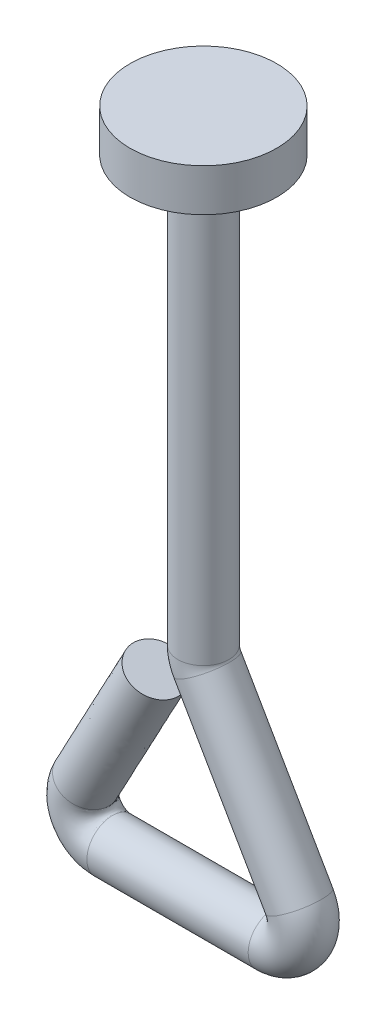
ISO-10303-21;
HEADER;
FILE_DESCRIPTION(('STEP AP214'),'2;1');
FILE_NAME('part.step','',(''),(''),'','','');
FILE_SCHEMA(('AUTOMOTIVE_DESIGN { 1 0 10303 214 1 1 1 1 }'));
ENDSEC;
DATA;
#1=APPLICATION_CONTEXT('core data for automotive mechanical design processes');
#2=APPLICATION_PROTOCOL_DEFINITION('international standard','automotive_design',2000,#1);
#3=PRODUCT_CONTEXT('',#1,'mechanical');
#4=PRODUCT('Part','Part','',(#3));
#5=PRODUCT_RELATED_PRODUCT_CATEGORY('part','',(#4));
#6=PRODUCT_DEFINITION_FORMATION('','',#4);
#7=PRODUCT_DEFINITION_CONTEXT('part definition',#1,'design');
#8=PRODUCT_DEFINITION('design','',#6,#7);
#9=PRODUCT_DEFINITION_SHAPE('','',#8);
#10=(LENGTH_UNIT() NAMED_UNIT(*) SI_UNIT(.MILLI.,.METRE.));
#11=(NAMED_UNIT(*) PLANE_ANGLE_UNIT() SI_UNIT($,.RADIAN.));
#12=(NAMED_UNIT(*) SI_UNIT($,.STERADIAN.) SOLID_ANGLE_UNIT());
#13=UNCERTAINTY_MEASURE_WITH_UNIT(LENGTH_MEASURE(1.E-05),#10,'distance_accuracy_value','');
#14=(GEOMETRIC_REPRESENTATION_CONTEXT(3) GLOBAL_UNCERTAINTY_ASSIGNED_CONTEXT((#13)) GLOBAL_UNIT_ASSIGNED_CONTEXT((#10,
#11,#12)) REPRESENTATION_CONTEXT('',''));
#15=CARTESIAN_POINT('',(0.,0.,0.));
#16=DIRECTION('',(0.,0.,1.));
#17=DIRECTION('',(1.,0.,0.));
#18=AXIS2_PLACEMENT_3D('',#15,#16,#17);
#19=CARTESIAN_POINT('',(8.27562342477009,-75.7716224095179,0.));
#20=DIRECTION('',(-1.,0.,0.));
#21=DIRECTION('',(0.,0.,1.));
#22=AXIS2_PLACEMENT_3D('',#19,#20,#21);
#23=CYLINDRICAL_SURFACE('',#22,3.);
#24=CARTESIAN_POINT('',(8.27562342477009,-75.7716224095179,0.));
#25=DIRECTION('',(1.,0.,0.));
#26=DIRECTION('',(0.,0.,1.));
#27=AXIS2_PLACEMENT_3D('',#24,#25,#26);
#28=CIRCLE('',#27,3.);
#29=CARTESIAN_POINT('',(8.27562342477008,-78.7716224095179,0.));
#30=VERTEX_POINT('',#29);
#31=EDGE_CURVE('E10',#30,#30,#28,.T.);
#32=ORIENTED_EDGE('',*,*,#31,.F.);
#33=EDGE_LOOP('',(#32));
#34=FACE_BOUND('',#33,.T.);
#35=CARTESIAN_POINT('',(-10.7243765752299,-75.7716224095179,0.));
#36=DIRECTION('',(1.,0.,0.));
#37=DIRECTION('',(0.,0.,1.));
#38=AXIS2_PLACEMENT_3D('',#35,#36,#37);
#39=CIRCLE('',#38,3.);
#40=CARTESIAN_POINT('',(-10.7243765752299,-75.7716224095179,3.));
#41=VERTEX_POINT('',#40);
#42=EDGE_CURVE('E49',#41,#41,#39,.T.);
#43=ORIENTED_EDGE('',*,*,#42,.T.);
#44=EDGE_LOOP('',(#43));
#45=FACE_BOUND('',#44,.T.);
#46=ADVANCED_FACE('F27',(#34,#45),#23,.T.);
#47=CARTESIAN_POINT('',(8.2756234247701,-72.2716224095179,0.));
#48=DIRECTION('',(0.,0.,-1.));
#49=DIRECTION('',(-1.,0.,0.));
#50=AXIS2_PLACEMENT_3D('',#47,#48,#49);
#51=TOROIDAL_SURFACE('',#50,3.50000000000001,3.);
#52=CARTESIAN_POINT('',(11.3067123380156,-70.5216224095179,0.));
#53=DIRECTION('',(-0.500000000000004,0.866025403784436,0.));
#54=DIRECTION('',(0.,0.,1.));
#55=AXIS2_PLACEMENT_3D('',#52,#53,#54);
#56=CIRCLE('',#55,3.);
#57=CARTESIAN_POINT('',(13.904788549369,-69.0216224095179,0.));
#58=VERTEX_POINT('',#57);
#59=EDGE_CURVE('E33',#58,#58,#56,.T.);
#60=CARTESIAN_POINT('',(8.2756234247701,-72.2716224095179,0.));
#61=DIRECTION('',(0.,0.,-1.));
#62=DIRECTION('',(-1.,0.,0.));
#63=AXIS2_PLACEMENT_3D('',#60,#61,#62);
#64=CIRCLE('',#63,6.50000000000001);
#65=EDGE_CURVE('',#58,#30,#64,.T.);
#66=ORIENTED_EDGE('',*,*,#59,.F.);
#67=ORIENTED_EDGE('',*,*,#31,.T.);
#68=ORIENTED_EDGE('',*,*,#65,.T.);
#69=ORIENTED_EDGE('',*,*,#65,.F.);
#70=EDGE_LOOP('',(#66,#68,#67,#69));
#71=FACE_BOUND('',#70,.T.);
#72=ADVANCED_FACE('F88',(#71),#51,.T.);
#73=CARTESIAN_POINT('',(0.468911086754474,-51.75,0.));
#74=DIRECTION('',(0.5,-0.866025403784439,0.));
#75=DIRECTION('',(0.866025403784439,0.5,0.));
#76=AXIS2_PLACEMENT_3D('',#73,#74,#75);
#77=CYLINDRICAL_SURFACE('',#76,3.);
#78=CARTESIAN_POINT('',(0.468911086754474,-51.75,0.));
#79=DIRECTION('',(-0.500000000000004,0.866025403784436,0.));
#80=DIRECTION('',(0.,0.,1.));
#81=AXIS2_PLACEMENT_3D('',#78,#79,#80);
#82=CIRCLE('',#81,3.);
#83=CARTESIAN_POINT('',(-2.12916512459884,-53.25,0.));
#84=VERTEX_POINT('',#83);
#85=EDGE_CURVE('E37',#84,#84,#82,.T.);
#86=ORIENTED_EDGE('',*,*,#85,.F.);
#87=EDGE_LOOP('',(#86));
#88=FACE_BOUND('',#87,.T.);
#89=ORIENTED_EDGE('',*,*,#59,.T.);
#90=EDGE_LOOP('',(#89));
#91=FACE_BOUND('',#90,.T.);
#92=ADVANCED_FACE('F93',(#88,#91),#77,.T.);
#93=CARTESIAN_POINT('',(3.5,-50.,0.));
#94=DIRECTION('',(0.,0.,1.));
#95=DIRECTION('',(1.,0.,0.));
#96=AXIS2_PLACEMENT_3D('',#93,#94,#95);
#97=TOROIDAL_SURFACE('',#96,3.5,3.);
#98=CARTESIAN_POINT('',(0.,-50.,0.));
#99=DIRECTION('',(0.,1.,0.));
#100=DIRECTION('',(0.,0.,1.));
#101=AXIS2_PLACEMENT_3D('',#98,#99,#100);
#102=CIRCLE('',#101,3.);
#103=CARTESIAN_POINT('',(-3.,-50.,0.));
#104=VERTEX_POINT('',#103);
#105=EDGE_CURVE('E41',#104,#104,#102,.T.);
#106=CARTESIAN_POINT('',(3.5,-50.,0.));
#107=DIRECTION('',(0.,0.,1.));
#108=DIRECTION('',(1.,0.,0.));
#109=AXIS2_PLACEMENT_3D('',#106,#107,#108);
#110=CIRCLE('',#109,6.5);
#111=EDGE_CURVE('',#104,#84,#110,.T.);
#112=ORIENTED_EDGE('',*,*,#105,.F.);
#113=ORIENTED_EDGE('',*,*,#85,.T.);
#114=ORIENTED_EDGE('',*,*,#111,.T.);
#115=ORIENTED_EDGE('',*,*,#111,.F.);
#116=EDGE_LOOP('',(#112,#114,#113,#115));
#117=FACE_BOUND('',#116,.T.);
#118=ADVANCED_FACE('F125',(#117),#97,.T.);
#119=CARTESIAN_POINT('',(0.,-50.,0.));
#120=DIRECTION('',(0.,1.,0.));
#121=DIRECTION('',(-1.,0.,0.));
#122=AXIS2_PLACEMENT_3D('',#119,#120,#121);
#123=CYLINDRICAL_SURFACE('',#122,3.);
#124=ORIENTED_EDGE('',*,*,#105,.T.);
#125=EDGE_LOOP('',(#124));
#126=FACE_BOUND('',#125,.T.);
#127=CARTESIAN_POINT('',(0.,0.,0.));
#128=DIRECTION('',(0.,1.,0.));
#129=DIRECTION('',(0.,0.,1.));
#130=AXIS2_PLACEMENT_3D('',#127,#128,#129);
#131=CIRCLE('',#130,3.);
#132=CARTESIAN_POINT('',(0.,0.,3.));
#133=VERTEX_POINT('',#132);
#134=EDGE_CURVE('E46',#133,#133,#131,.T.);
#135=ORIENTED_EDGE('',*,*,#134,.F.);
#136=EDGE_LOOP('',(#135));
#137=FACE_BOUND('',#136,.T.);
#138=ADVANCED_FACE('F101',(#126,#137),#123,.T.);
#139=CARTESIAN_POINT('',(-10.7243765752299,-75.7716224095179,3.));
#140=CARTESIAN_POINT('',(-11.0029869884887,-75.7716224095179,3.));
#141=CARTESIAN_POINT('',(-11.3965676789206,-75.725559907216,3.));
#142=CARTESIAN_POINT('',(-12.0763005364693,-75.5255246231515,3.));
#143=CARTESIAN_POINT('',(-12.6507157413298,-75.2164198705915,3.));
#144=CARTESIAN_POINT('',(-13.1405002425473,-74.8280954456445,3.));
#145=CARTESIAN_POINT('',(-13.5554961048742,-74.3607770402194,3.));
#146=CARTESIAN_POINT('',(-13.877221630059,-73.8345836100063,3.));
#147=CARTESIAN_POINT('',(-14.0924547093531,-73.2771343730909,3.));
#148=CARTESIAN_POINT('',(-14.2024187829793,-72.7581557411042,3.));
#149=CARTESIAN_POINT('',(-14.2354161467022,-72.2553939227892,3.));
#150=CARTESIAN_POINT('',(-14.1990538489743,-71.7366649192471,3.));
#151=CARTESIAN_POINT('',(-14.0564109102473,-71.1511355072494,3.));
#152=CARTESIAN_POINT('',(-13.9162275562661,-70.8110262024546,3.));
#153=CARTESIAN_POINT('',(-13.7870179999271,-70.5774478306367,3.));
#154=CARTESIAN_POINT('',(-10.7243765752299,-81.7716224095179,3.));
#155=CARTESIAN_POINT('',(-11.0029869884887,-81.7716224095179,3.));
#156=CARTESIAN_POINT('',(-12.7664353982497,-81.6465959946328,3.));
#157=CARTESIAN_POINT('',(-14.3383698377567,-81.1036414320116,3.));
#158=CARTESIAN_POINT('',(-15.9668125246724,-80.2646485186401,3.));
#159=CARTESIAN_POINT('',(-17.279086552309,-79.2106055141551,3.));
#160=CARTESIAN_POINT('',(-18.4098830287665,-77.9422405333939,3.));
#161=CARTESIAN_POINT('',(-19.281718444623,-76.5137156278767,3.));
#162=CARTESIAN_POINT('',(-19.866757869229,-75.001588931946,3.));
#163=CARTESIAN_POINT('',(-20.1635224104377,-73.5899678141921,3.));
#164=CARTESIAN_POINT('',(-20.2585707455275,-72.235213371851,3.));
#165=CARTESIAN_POINT('',(-20.1369248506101,-70.7857584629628,3.));
#166=CARTESIAN_POINT('',(-19.8532226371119,-69.3835119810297,3.));
#167=CARTESIAN_POINT('',(-19.1853430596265,-67.9408446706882,3.));
#168=CARTESIAN_POINT('',(-19.0561335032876,-67.7072662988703,3.));
#169=CARTESIAN_POINT('',(-10.7243765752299,-81.7716224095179,-3.));
#170=CARTESIAN_POINT('',(-11.0029869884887,-81.7716224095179,-3.));
#171=CARTESIAN_POINT('',(-12.7664353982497,-81.6465959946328,-3.));
#172=CARTESIAN_POINT('',(-14.3383698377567,-81.1036414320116,-3.));
#173=CARTESIAN_POINT('',(-15.9668125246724,-80.2646485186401,-3.));
#174=CARTESIAN_POINT('',(-17.279086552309,-79.2106055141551,-3.));
#175=CARTESIAN_POINT('',(-18.4098830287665,-77.9422405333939,-3.));
#176=CARTESIAN_POINT('',(-19.281718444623,-76.5137156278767,-3.));
#177=CARTESIAN_POINT('',(-19.866757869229,-75.001588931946,-3.));
#178=CARTESIAN_POINT('',(-20.1635224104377,-73.5899678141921,-3.));
#179=CARTESIAN_POINT('',(-20.2585707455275,-72.235213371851,-3.));
#180=CARTESIAN_POINT('',(-20.1369248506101,-70.7857584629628,-3.));
#181=CARTESIAN_POINT('',(-19.8532226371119,-69.3835119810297,-3.));
#182=CARTESIAN_POINT('',(-19.1853430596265,-67.9408446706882,-3.));
#183=CARTESIAN_POINT('',(-19.0561335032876,-67.7072662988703,-3.));
#184=CARTESIAN_POINT('',(-10.7243765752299,-75.7716224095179,-3.));
#185=CARTESIAN_POINT('',(-11.0029869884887,-75.7716224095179,-3.));
#186=CARTESIAN_POINT('',(-11.3965676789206,-75.725559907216,-3.));
#187=CARTESIAN_POINT('',(-12.0763005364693,-75.5255246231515,-3.));
#188=CARTESIAN_POINT('',(-12.6507157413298,-75.2164198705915,-3.));
#189=CARTESIAN_POINT('',(-13.1405002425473,-74.8280954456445,-3.));
#190=CARTESIAN_POINT('',(-13.5554961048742,-74.3607770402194,-3.));
#191=CARTESIAN_POINT('',(-13.877221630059,-73.8345836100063,-3.));
#192=CARTESIAN_POINT('',(-14.0924547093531,-73.2771343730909,-3.));
#193=CARTESIAN_POINT('',(-14.2024187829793,-72.7581557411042,-3.));
#194=CARTESIAN_POINT('',(-14.2354161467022,-72.2553939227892,-3.));
#195=CARTESIAN_POINT('',(-14.1990538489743,-71.7366649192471,-3.));
#196=CARTESIAN_POINT('',(-14.0564109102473,-71.1511355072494,-3.));
#197=CARTESIAN_POINT('',(-13.9162275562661,-70.8110262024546,-3.));
#198=CARTESIAN_POINT('',(-13.7870179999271,-70.5774478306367,-3.));
#199=CARTESIAN_POINT('',(-10.7243765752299,-69.7716224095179,-3.));
#200=CARTESIAN_POINT('',(-11.0029869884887,-69.7716224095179,-3.));
#201=CARTESIAN_POINT('',(-10.0266999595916,-69.8045238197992,-3.));
#202=CARTESIAN_POINT('',(-9.81423123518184,-69.9474078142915,-3.));
#203=CARTESIAN_POINT('',(-9.33461895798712,-70.1681912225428,-3.));
#204=CARTESIAN_POINT('',(-9.00191393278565,-70.4455853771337,-3.));
#205=CARTESIAN_POINT('',(-8.70110918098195,-70.7793135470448,-3.));
#206=CARTESIAN_POINT('',(-8.4727248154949,-71.1554515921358,-3.));
#207=CARTESIAN_POINT('',(-8.31815154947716,-71.5526798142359,-3.));
#208=CARTESIAN_POINT('',(-8.24131515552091,-71.9263436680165,-3.));
#209=CARTESIAN_POINT('',(-8.21226154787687,-72.2755744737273,-3.));
#210=CARTESIAN_POINT('',(-8.26118284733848,-72.6875713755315,-3.));
#211=CARTESIAN_POINT('',(-8.25959918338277,-72.918759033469,-3.));
#212=CARTESIAN_POINT('',(-8.64711205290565,-73.681207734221,-3.));
#213=CARTESIAN_POINT('',(-8.51790249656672,-73.4476293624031,-3.));
#214=CARTESIAN_POINT('',(-10.7243765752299,-69.7716224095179,3.));
#215=CARTESIAN_POINT('',(-11.0029869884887,-69.7716224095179,3.));
#216=CARTESIAN_POINT('',(-10.0266999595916,-69.8045238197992,3.));
#217=CARTESIAN_POINT('',(-9.81423123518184,-69.9474078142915,3.));
#218=CARTESIAN_POINT('',(-9.33461895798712,-70.1681912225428,3.));
#219=CARTESIAN_POINT('',(-9.00191393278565,-70.4455853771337,3.));
#220=CARTESIAN_POINT('',(-8.70110918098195,-70.7793135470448,3.));
#221=CARTESIAN_POINT('',(-8.4727248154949,-71.1554515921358,3.));
#222=CARTESIAN_POINT('',(-8.31815154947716,-71.5526798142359,3.));
#223=CARTESIAN_POINT('',(-8.24131515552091,-71.9263436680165,3.));
#224=CARTESIAN_POINT('',(-8.21226154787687,-72.2755744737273,3.));
#225=CARTESIAN_POINT('',(-8.26118284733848,-72.6875713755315,3.));
#226=CARTESIAN_POINT('',(-8.25959918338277,-72.918759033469,3.));
#227=CARTESIAN_POINT('',(-8.64711205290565,-73.681207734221,3.));
#228=CARTESIAN_POINT('',(-8.51790249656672,-73.4476293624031,3.));
#229=CARTESIAN_POINT('',(-10.7243765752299,-75.7716224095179,3.));
#230=CARTESIAN_POINT('',(-11.0029869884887,-75.7716224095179,3.));
#231=CARTESIAN_POINT('',(-11.3965676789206,-75.725559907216,3.));
#232=CARTESIAN_POINT('',(-12.0763005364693,-75.5255246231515,3.));
#233=CARTESIAN_POINT('',(-12.6507157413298,-75.2164198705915,3.));
#234=CARTESIAN_POINT('',(-13.1405002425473,-74.8280954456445,3.));
#235=CARTESIAN_POINT('',(-13.5554961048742,-74.3607770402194,3.));
#236=CARTESIAN_POINT('',(-13.877221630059,-73.8345836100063,3.));
#237=CARTESIAN_POINT('',(-14.0924547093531,-73.2771343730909,3.));
#238=CARTESIAN_POINT('',(-14.2024187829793,-72.7581557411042,3.));
#239=CARTESIAN_POINT('',(-14.2354161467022,-72.2553939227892,3.));
#240=CARTESIAN_POINT('',(-14.1990538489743,-71.7366649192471,3.));
#241=CARTESIAN_POINT('',(-14.0564109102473,-71.1511355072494,3.));
#242=CARTESIAN_POINT('',(-13.9162275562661,-70.8110262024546,3.));
#243=CARTESIAN_POINT('',(-13.7870179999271,-70.5774478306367,3.));
#244=(BOUNDED_SURFACE() B_SPLINE_SURFACE(3,3,((#139,#140,#141,#142,#143,#144,#145,#146,#147,
#148,#149,#150,#151,#152,#153),(#154,#155,#156,#157,#158,#159,#160,#161,#162,#163,#164,#165,
#166,#167,#168),(#169,#170,#171,#172,#173,#174,#175,#176,#177,#178,#179,#180,#181,#182,#183),
(#184,#185,#186,#187,#188,#189,#190,#191,#192,#193,#194,#195,#196,#197,#198),(#199,#200,#201,
#202,#203,#204,#205,#206,#207,#208,#209,#210,#211,#212,#213),(#214,#215,#216,#217,#218,#219,
#220,#221,#222,#223,#224,#225,#226,#227,#228),(#229,#230,#231,#232,#233,#234,#235,#236,#237,
#238,#239,#240,#241,#242,#243)),.UNSPECIFIED.,.T.,.F.,.F.) B_SPLINE_SURFACE_WITH_KNOTS((4,3,4),
(4,1,1,1,1,1,1,1,1,1,1,1,4),(0.,0.5,1.),(0.,0.0961908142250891,0.190513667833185,
0.281309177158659,0.367280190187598,0.447560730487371,0.539213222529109,0.621189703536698,
0.693941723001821,0.758246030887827,0.829027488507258,0.910014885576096,1.),
.UNSPECIFIED.) GEOMETRIC_REPRESENTATION_ITEM() RATIONAL_B_SPLINE_SURFACE(((1.,1.,1.,1.,1.,1.,1.,
1.,1.,1.,1.,1.,1.,1.,1.),(0.333333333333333,0.333333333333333,0.333333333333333,
0.333333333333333,0.333333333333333,0.333333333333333,0.333333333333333,0.333333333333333,
0.333333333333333,0.333333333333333,0.333333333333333,0.333333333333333,0.333333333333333,
0.333333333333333,0.333333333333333),(0.333333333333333,0.333333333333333,0.333333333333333,
0.333333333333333,0.333333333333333,0.333333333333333,0.333333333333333,0.333333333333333,
0.333333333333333,0.333333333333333,0.333333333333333,0.333333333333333,0.333333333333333,
0.333333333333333,0.333333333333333),(1.,1.,1.,1.,1.,1.,1.,1.,1.,1.,1.,1.,1.,1.,1.),
(0.333333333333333,0.333333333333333,0.333333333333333,0.333333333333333,0.333333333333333,
0.333333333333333,0.333333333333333,0.333333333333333,0.333333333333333,0.333333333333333,
0.333333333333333,0.333333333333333,0.333333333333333,0.333333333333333,0.333333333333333),
(0.333333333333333,0.333333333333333,0.333333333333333,0.333333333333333,0.333333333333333,
0.333333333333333,0.333333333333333,0.333333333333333,0.333333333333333,0.333333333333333,
0.333333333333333,0.333333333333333,0.333333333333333,0.333333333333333,0.333333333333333),(1.,
1.,1.,1.,1.,1.,1.,1.,1.,1.,1.,1.,1.,1.,1.))) REPRESENTATION_ITEM('') SURFACE());
#245=CARTESIAN_POINT('',(-13.7870179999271,-70.5774478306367,3.));
#246=CARTESIAN_POINT('',(-19.0561335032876,-67.7072662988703,3.));
#247=CARTESIAN_POINT('',(-19.0561335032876,-67.7072662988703,-3.));
#248=CARTESIAN_POINT('',(-13.7870179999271,-70.5774478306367,-3.));
#249=CARTESIAN_POINT('',(-8.51790249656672,-73.4476293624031,-3.));
#250=CARTESIAN_POINT('',(-8.51790249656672,-73.4476293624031,3.));
#251=CARTESIAN_POINT('',(-13.7870179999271,-70.5774478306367,3.));
#252=(BOUNDED_CURVE() B_SPLINE_CURVE(3,(#245,#246,#247,#248,#249,#250,#251),.UNSPECIFIED.,.T.,
.F.) B_SPLINE_CURVE_WITH_KNOTS((4,3,4),(0.,0.5,1.),
.UNSPECIFIED.) CURVE() GEOMETRIC_REPRESENTATION_ITEM() RATIONAL_B_SPLINE_CURVE((1.,
0.333333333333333,0.333333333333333,1.,0.333333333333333,0.333333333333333,1.)) REPRESENTATION_ITEM(''));
#253=CARTESIAN_POINT('',(-13.7870179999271,-70.5774478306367,3.));
#254=VERTEX_POINT('',#253);
#255=EDGE_CURVE('E52',#254,#254,#252,.F.);
#256=ORIENTED_EDGE('',*,*,#42,.F.);
#257=EDGE_LOOP('',(#256));
#258=FACE_BOUND('',#257,.T.);
#259=ORIENTED_EDGE('',*,*,#255,.F.);
#260=EDGE_LOOP('',(#259));
#261=FACE_BOUND('',#260,.T.);
#262=ADVANCED_FACE('F98',(#258,#261),#244,.F.);
#263=CARTESIAN_POINT('',(-5.59214455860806,-55.2976595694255,-3.));
#264=DIRECTION('',(-0.47263689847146,-0.881257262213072,0.));
#265=DIRECTION('',(0.881257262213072,-0.47263689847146,0.));
#266=AXIS2_PLACEMENT_3D('',#263,#264,#265);
#267=PLANE('',#266);
#268=CARTESIAN_POINT('',(-5.59214455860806,-55.2976595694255,0.));
#269=DIRECTION('',(-0.472636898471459,-0.881257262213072,0.));
#270=DIRECTION('',(0.881257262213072,-0.472636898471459,0.));
#271=AXIS2_PLACEMENT_3D('',#268,#269,#270);
#272=CIRCLE('',#271,3.);
#273=CARTESIAN_POINT('',(-2.94837277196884,-56.7155702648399,0.));
#274=VERTEX_POINT('',#273);
#275=EDGE_CURVE('E57',#274,#274,#272,.T.);
#276=ORIENTED_EDGE('',*,*,#275,.F.);
#277=EDGE_LOOP('',(#276));
#278=FACE_BOUND('',#277,.T.);
#279=ADVANCED_FACE('F85',(#278),#267,.F.);
#280=CARTESIAN_POINT('',(-13.7870179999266,-70.5774478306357,3.));
#281=CARTESIAN_POINT('',(-11.0553935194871,-65.484185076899,3.));
#282=CARTESIAN_POINT('',(-8.32376903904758,-60.3909223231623,3.));
#283=CARTESIAN_POINT('',(-5.59214455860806,-55.2976595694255,3.));
#284=CARTESIAN_POINT('',(-8.5179024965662,-73.4476293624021,3.));
#285=CARTESIAN_POINT('',(-5.78013532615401,-68.3429132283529,3.));
#286=CARTESIAN_POINT('',(-3.04236815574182,-63.2381970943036,3.));
#287=CARTESIAN_POINT('',(-0.304600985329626,-58.1334809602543,3.));
#288=CARTESIAN_POINT('',(-8.5179024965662,-73.4476293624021,-3.));
#289=CARTESIAN_POINT('',(-5.78013532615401,-68.3429132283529,-3.));
#290=CARTESIAN_POINT('',(-3.04236815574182,-63.2381970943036,-3.));
#291=CARTESIAN_POINT('',(-0.304600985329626,-58.1334809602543,-3.));
#292=CARTESIAN_POINT('',(-13.7870179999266,-70.5774478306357,-3.));
#293=CARTESIAN_POINT('',(-11.0553935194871,-65.484185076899,-3.));
#294=CARTESIAN_POINT('',(-8.32376903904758,-60.3909223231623,-3.));
#295=CARTESIAN_POINT('',(-5.59214455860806,-55.2976595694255,-3.));
#296=CARTESIAN_POINT('',(-19.056133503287,-67.7072662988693,-3.));
#297=CARTESIAN_POINT('',(-16.3306517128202,-62.6254569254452,-3.));
#298=CARTESIAN_POINT('',(-13.6051699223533,-57.543647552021,-3.));
#299=CARTESIAN_POINT('',(-10.8796881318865,-52.4618381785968,-3.));
#300=CARTESIAN_POINT('',(-19.056133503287,-67.7072662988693,3.));
#301=CARTESIAN_POINT('',(-16.3306517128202,-62.6254569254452,3.));
#302=CARTESIAN_POINT('',(-13.6051699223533,-57.543647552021,3.));
#303=CARTESIAN_POINT('',(-10.8796881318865,-52.4618381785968,3.));
#304=CARTESIAN_POINT('',(-13.7870179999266,-70.5774478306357,3.));
#305=CARTESIAN_POINT('',(-11.0553935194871,-65.484185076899,3.));
#306=CARTESIAN_POINT('',(-8.32376903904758,-60.3909223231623,3.));
#307=CARTESIAN_POINT('',(-5.59214455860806,-55.2976595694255,3.));
#308=(BOUNDED_SURFACE() B_SPLINE_SURFACE(3,3,((#280,#281,#282,#283),(#284,#285,#286,#287),(#288,
#289,#290,#291),(#292,#293,#294,#295),(#296,#297,#298,#299),(#300,#301,#302,#303),(#304,#305,
#306,#307)),.UNSPECIFIED.,.T.,.F.,.F.) B_SPLINE_SURFACE_WITH_KNOTS((4,3,4),(4,4),(0.,0.5,1.),
(0.,1.),.UNSPECIFIED.) GEOMETRIC_REPRESENTATION_ITEM() RATIONAL_B_SPLINE_SURFACE(((1.,1.,1.,1.),
(0.333333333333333,0.333333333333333,0.333333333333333,0.333333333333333),(0.333333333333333,
0.333333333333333,0.333333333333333,0.333333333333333),(1.,1.,1.,1.),(0.333333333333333,
0.333333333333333,0.333333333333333,0.333333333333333),(0.333333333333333,0.333333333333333,
0.333333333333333,0.333333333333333),(1.,1.,1.,1.))) REPRESENTATION_ITEM('') SURFACE());
#309=ORIENTED_EDGE('',*,*,#255,.T.);
#310=EDGE_LOOP('',(#309));
#311=FACE_BOUND('',#310,.T.);
#312=ORIENTED_EDGE('',*,*,#275,.T.);
#313=EDGE_LOOP('',(#312));
#314=FACE_BOUND('',#313,.T.);
#315=ADVANCED_FACE('F82',(#311,#314),#308,.T.);
#316=CARTESIAN_POINT('',(0.,0.,0.));
#317=DIRECTION('',(0.,1.,0.));
#318=DIRECTION('',(0.,0.,1.));
#319=AXIS2_PLACEMENT_3D('',#316,#317,#318);
#320=PLANE('',#319);
#321=CARTESIAN_POINT('',(0.,0.,0.));
#322=DIRECTION('',(0.,1.,0.));
#323=DIRECTION('',(0.,0.,1.));
#324=AXIS2_PLACEMENT_3D('',#321,#322,#323);
#325=CIRCLE('',#324,8.64464877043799);
#326=CARTESIAN_POINT('',(0.,0.,8.64464877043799));
#327=VERTEX_POINT('',#326);
#328=EDGE_CURVE('E63',#327,#327,#325,.T.);
#329=ORIENTED_EDGE('',*,*,#328,.F.);
#330=EDGE_LOOP('',(#329));
#331=FACE_BOUND('',#330,.T.);
#332=ORIENTED_EDGE('',*,*,#134,.T.);
#333=EDGE_LOOP('',(#332));
#334=FACE_BOUND('',#333,.T.);
#335=ADVANCED_FACE('F74',(#331,#334),#320,.F.);
#336=CARTESIAN_POINT('',(0.,4.,0.));
#337=DIRECTION('',(0.,-1.,0.));
#338=DIRECTION('',(0.,0.,-1.));
#339=AXIS2_PLACEMENT_3D('',#336,#337,#338);
#340=CYLINDRICAL_SURFACE('',#339,8.64464877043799);
#341=ORIENTED_EDGE('',*,*,#328,.T.);
#342=EDGE_LOOP('',(#341));
#343=FACE_BOUND('',#342,.T.);
#344=CARTESIAN_POINT('',(0.,5.,0.));
#345=DIRECTION('',(0.,1.,0.));
#346=DIRECTION('',(0.,0.,1.));
#347=AXIS2_PLACEMENT_3D('',#344,#345,#346);
#348=CIRCLE('',#347,8.64464877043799);
#349=CARTESIAN_POINT('',(0.,5.,8.64464877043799));
#350=VERTEX_POINT('',#349);
#351=EDGE_CURVE('E66',#350,#350,#348,.T.);
#352=ORIENTED_EDGE('',*,*,#351,.F.);
#353=EDGE_LOOP('',(#352));
#354=FACE_BOUND('',#353,.T.);
#355=ADVANCED_FACE('F72',(#343,#354),#340,.T.);
#356=CARTESIAN_POINT('',(0.,5.,0.));
#357=DIRECTION('',(0.,1.,0.));
#358=DIRECTION('',(0.,0.,1.));
#359=AXIS2_PLACEMENT_3D('',#356,#357,#358);
#360=PLANE('',#359);
#361=ORIENTED_EDGE('',*,*,#351,.T.);
#362=EDGE_LOOP('',(#361));
#363=FACE_BOUND('',#362,.T.);
#364=ADVANCED_FACE('F70',(#363),#360,.T.);
#365=CLOSED_SHELL('',(#46,#72,#92,#118,#138,#262,#279,#315,#335,#355,#364));
#366=MANIFOLD_SOLID_BREP('B2',#365);
#367=ADVANCED_BREP_SHAPE_REPRESENTATION('',(#18,#366),#14);
#368=SHAPE_DEFINITION_REPRESENTATION(#9,#367);
ENDSEC;
END-ISO-10303-21;
